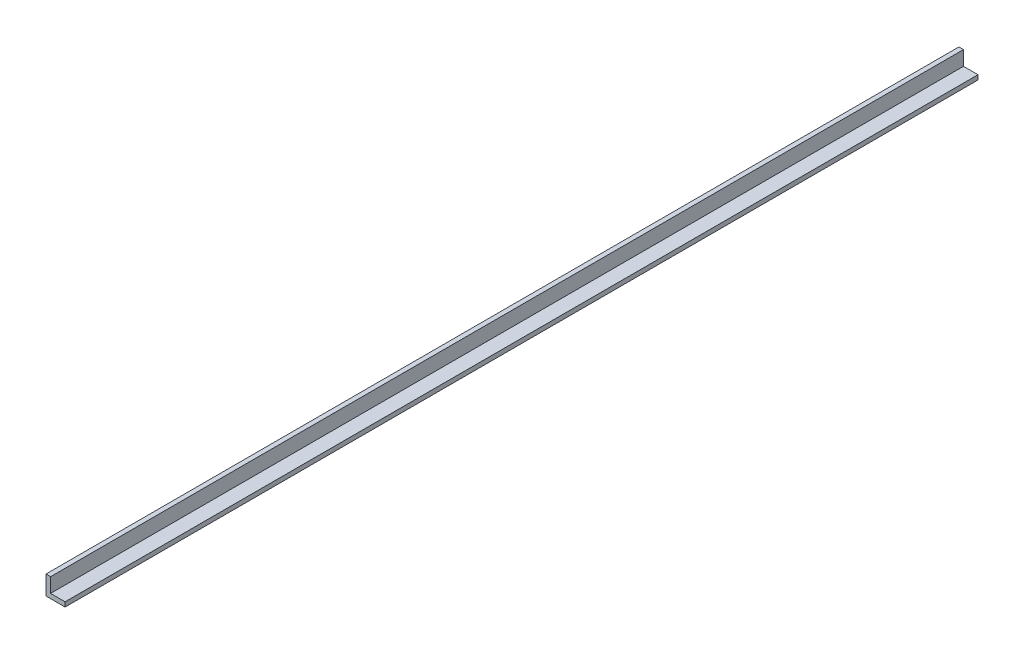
ISO-10303-21;
HEADER;
FILE_DESCRIPTION(('STEP AP214'),'2;1');
FILE_NAME('part.step','',(''),(''),'','','');
FILE_SCHEMA(('AUTOMOTIVE_DESIGN { 1 0 10303 214 1 1 1 1 }'));
ENDSEC;
DATA;
#1=APPLICATION_CONTEXT('core data for automotive mechanical design processes');
#2=APPLICATION_PROTOCOL_DEFINITION('international standard','automotive_design',2000,#1);
#3=PRODUCT_CONTEXT('',#1,'mechanical');
#4=PRODUCT('Part','Part','',(#3));
#5=PRODUCT_RELATED_PRODUCT_CATEGORY('part','',(#4));
#6=PRODUCT_DEFINITION_FORMATION('','',#4);
#7=PRODUCT_DEFINITION_CONTEXT('part definition',#1,'design');
#8=PRODUCT_DEFINITION('design','',#6,#7);
#9=PRODUCT_DEFINITION_SHAPE('','',#8);
#10=(LENGTH_UNIT() NAMED_UNIT(*) SI_UNIT(.MILLI.,.METRE.));
#11=(NAMED_UNIT(*) PLANE_ANGLE_UNIT() SI_UNIT($,.RADIAN.));
#12=(NAMED_UNIT(*) SI_UNIT($,.STERADIAN.) SOLID_ANGLE_UNIT());
#13=UNCERTAINTY_MEASURE_WITH_UNIT(LENGTH_MEASURE(1.E-05),#10,'distance_accuracy_value','');
#14=(GEOMETRIC_REPRESENTATION_CONTEXT(3) GLOBAL_UNCERTAINTY_ASSIGNED_CONTEXT((#13)) GLOBAL_UNIT_ASSIGNED_CONTEXT((#10,
#11,#12)) REPRESENTATION_CONTEXT('',''));
#15=CARTESIAN_POINT('',(0.,0.,0.));
#16=DIRECTION('',(0.,0.,1.));
#17=DIRECTION('',(1.,0.,0.));
#18=AXIS2_PLACEMENT_3D('',#15,#16,#17);
#19=CARTESIAN_POINT('',(0.,0.,2390.));
#20=DIRECTION('',(1.,0.,0.));
#21=DIRECTION('',(0.,0.,-1.));
#22=AXIS2_PLACEMENT_3D('',#19,#20,#21);
#23=PLANE('',#22);
#24=DIRECTION('',(0.,-1.,0.));
#25=VECTOR('',#24,1.);
#26=CARTESIAN_POINT('',(0.,0.,0.));
#27=LINE('',#26,#25);
#28=CARTESIAN_POINT('',(0.,50.,0.));
#29=VERTEX_POINT('',#28);
#30=CARTESIAN_POINT('',(0.,0.,0.));
#31=VERTEX_POINT('',#30);
#32=EDGE_CURVE('E117',#29,#31,#27,.T.);
#33=ORIENTED_EDGE('',*,*,#32,.T.);
#34=DIRECTION('',(0.,0.,-1.));
#35=VECTOR('',#34,1.);
#36=CARTESIAN_POINT('',(0.,0.,2390.));
#37=LINE('',#36,#35);
#38=CARTESIAN_POINT('',(0.,0.,2390.));
#39=VERTEX_POINT('',#38);
#40=EDGE_CURVE('E11',#39,#31,#37,.T.);
#41=ORIENTED_EDGE('',*,*,#40,.F.);
#42=DIRECTION('',(0.,-1.,0.));
#43=VECTOR('',#42,1.);
#44=CARTESIAN_POINT('',(0.,0.,2390.));
#45=LINE('',#44,#43);
#46=CARTESIAN_POINT('',(0.,50.,2390.));
#47=VERTEX_POINT('',#46);
#48=EDGE_CURVE('E127',#47,#39,#45,.T.);
#49=ORIENTED_EDGE('',*,*,#48,.F.);
#50=DIRECTION('',(0.,0.,-1.));
#51=VECTOR('',#50,1.);
#52=CARTESIAN_POINT('',(0.,50.,2390.));
#53=LINE('',#52,#51);
#54=EDGE_CURVE('E113',#47,#29,#53,.T.);
#55=ORIENTED_EDGE('',*,*,#54,.T.);
#56=EDGE_LOOP('',(#33,#41,#49,#55));
#57=FACE_BOUND('',#56,.T.);
#58=ADVANCED_FACE('F33',(#57),#23,.F.);
#59=CARTESIAN_POINT('',(0.,0.,2390.));
#60=DIRECTION('',(0.,1.,0.));
#61=DIRECTION('',(0.,0.,1.));
#62=AXIS2_PLACEMENT_3D('',#59,#60,#61);
#63=PLANE('',#62);
#64=DIRECTION('',(1.,0.,0.));
#65=VECTOR('',#64,1.);
#66=CARTESIAN_POINT('',(0.,0.,0.));
#67=LINE('',#66,#65);
#68=CARTESIAN_POINT('',(50.,0.,0.));
#69=VERTEX_POINT('',#68);
#70=EDGE_CURVE('E120',#31,#69,#67,.T.);
#71=ORIENTED_EDGE('',*,*,#70,.T.);
#72=DIRECTION('',(0.,0.,-1.));
#73=VECTOR('',#72,1.);
#74=CARTESIAN_POINT('',(50.,0.,2390.));
#75=LINE('',#74,#73);
#76=CARTESIAN_POINT('',(50.,0.,2390.));
#77=VERTEX_POINT('',#76);
#78=EDGE_CURVE('E41',#77,#69,#75,.T.);
#79=ORIENTED_EDGE('',*,*,#78,.F.);
#80=DIRECTION('',(1.,0.,0.));
#81=VECTOR('',#80,1.);
#82=CARTESIAN_POINT('',(0.,0.,2390.));
#83=LINE('',#82,#81);
#84=EDGE_CURVE('E86',#39,#77,#83,.T.);
#85=ORIENTED_EDGE('',*,*,#84,.F.);
#86=ORIENTED_EDGE('',*,*,#40,.T.);
#87=EDGE_LOOP('',(#71,#79,#85,#86));
#88=FACE_BOUND('',#87,.T.);
#89=ADVANCED_FACE('F151',(#88),#63,.F.);
#90=CARTESIAN_POINT('',(50.,0.,2390.));
#91=DIRECTION('',(-1.,0.,0.));
#92=DIRECTION('',(0.,0.,1.));
#93=AXIS2_PLACEMENT_3D('',#90,#91,#92);
#94=PLANE('',#93);
#95=DIRECTION('',(0.,1.,0.));
#96=VECTOR('',#95,1.);
#97=CARTESIAN_POINT('',(50.,0.,0.));
#98=LINE('',#97,#96);
#99=CARTESIAN_POINT('',(50.,12.,0.));
#100=VERTEX_POINT('',#99);
#101=EDGE_CURVE('E122',#69,#100,#98,.T.);
#102=ORIENTED_EDGE('',*,*,#101,.T.);
#103=DIRECTION('',(0.,0.,-1.));
#104=VECTOR('',#103,1.);
#105=CARTESIAN_POINT('',(50.,12.,2390.));
#106=LINE('',#105,#104);
#107=CARTESIAN_POINT('',(50.,12.,2390.));
#108=VERTEX_POINT('',#107);
#109=EDGE_CURVE('E108',#108,#100,#106,.T.);
#110=ORIENTED_EDGE('',*,*,#109,.F.);
#111=DIRECTION('',(0.,1.,0.));
#112=VECTOR('',#111,1.);
#113=CARTESIAN_POINT('',(50.,0.,2390.));
#114=LINE('',#113,#112);
#115=EDGE_CURVE('E99',#77,#108,#114,.T.);
#116=ORIENTED_EDGE('',*,*,#115,.F.);
#117=ORIENTED_EDGE('',*,*,#78,.T.);
#118=EDGE_LOOP('',(#102,#110,#116,#117));
#119=FACE_BOUND('',#118,.T.);
#120=ADVANCED_FACE('F133',(#119),#94,.F.);
#121=CARTESIAN_POINT('',(12.,12.,2390.));
#122=DIRECTION('',(0.,-1.,0.));
#123=DIRECTION('',(0.,0.,-1.));
#124=AXIS2_PLACEMENT_3D('',#121,#122,#123);
#125=PLANE('',#124);
#126=DIRECTION('',(-1.,0.,0.));
#127=VECTOR('',#126,1.);
#128=CARTESIAN_POINT('',(12.,12.,0.));
#129=LINE('',#128,#127);
#130=CARTESIAN_POINT('',(12.,12.,0.));
#131=VERTEX_POINT('',#130);
#132=EDGE_CURVE('E107',#100,#131,#129,.T.);
#133=ORIENTED_EDGE('',*,*,#132,.T.);
#134=DIRECTION('',(0.,0.,-1.));
#135=VECTOR('',#134,1.);
#136=CARTESIAN_POINT('',(12.,12.,2390.));
#137=LINE('',#136,#135);
#138=CARTESIAN_POINT('',(12.,12.,2390.));
#139=VERTEX_POINT('',#138);
#140=EDGE_CURVE('E104',#139,#131,#137,.T.);
#141=ORIENTED_EDGE('',*,*,#140,.F.);
#142=DIRECTION('',(-1.,0.,0.));
#143=VECTOR('',#142,1.);
#144=CARTESIAN_POINT('',(12.,12.,2390.));
#145=LINE('',#144,#143);
#146=EDGE_CURVE('E93',#108,#139,#145,.T.);
#147=ORIENTED_EDGE('',*,*,#146,.F.);
#148=ORIENTED_EDGE('',*,*,#109,.T.);
#149=EDGE_LOOP('',(#133,#141,#147,#148));
#150=FACE_BOUND('',#149,.T.);
#151=ADVANCED_FACE('F105',(#150),#125,.F.);
#152=CARTESIAN_POINT('',(12.,12.,2390.));
#153=DIRECTION('',(-1.,0.,0.));
#154=DIRECTION('',(0.,-1.,0.));
#155=AXIS2_PLACEMENT_3D('',#152,#153,#154);
#156=PLANE('',#155);
#157=DIRECTION('',(0.,1.,0.));
#158=VECTOR('',#157,1.);
#159=CARTESIAN_POINT('',(12.,12.,0.));
#160=LINE('',#159,#158);
#161=CARTESIAN_POINT('',(12.,50.,0.));
#162=VERTEX_POINT('',#161);
#163=EDGE_CURVE('E72',#131,#162,#160,.T.);
#164=ORIENTED_EDGE('',*,*,#163,.T.);
#165=DIRECTION('',(0.,0.,-1.));
#166=VECTOR('',#165,1.);
#167=CARTESIAN_POINT('',(12.,50.,2390.));
#168=LINE('',#167,#166);
#169=CARTESIAN_POINT('',(12.,50.,2390.));
#170=VERTEX_POINT('',#169);
#171=EDGE_CURVE('E109',#170,#162,#168,.T.);
#172=ORIENTED_EDGE('',*,*,#171,.F.);
#173=DIRECTION('',(0.,1.,0.));
#174=VECTOR('',#173,1.);
#175=CARTESIAN_POINT('',(12.,12.,2390.));
#176=LINE('',#175,#174);
#177=EDGE_CURVE('E97',#139,#170,#176,.T.);
#178=ORIENTED_EDGE('',*,*,#177,.F.);
#179=ORIENTED_EDGE('',*,*,#140,.T.);
#180=EDGE_LOOP('',(#164,#172,#178,#179));
#181=FACE_BOUND('',#180,.T.);
#182=ADVANCED_FACE('F111',(#181),#156,.F.);
#183=CARTESIAN_POINT('',(12.,50.,2390.));
#184=DIRECTION('',(0.,-1.,0.));
#185=DIRECTION('',(0.,0.,-1.));
#186=AXIS2_PLACEMENT_3D('',#183,#184,#185);
#187=PLANE('',#186);
#188=DIRECTION('',(-1.,0.,0.));
#189=VECTOR('',#188,1.);
#190=CARTESIAN_POINT('',(12.,50.,0.));
#191=LINE('',#190,#189);
#192=EDGE_CURVE('E78',#162,#29,#191,.T.);
#193=ORIENTED_EDGE('',*,*,#192,.T.);
#194=ORIENTED_EDGE('',*,*,#54,.F.);
#195=DIRECTION('',(-1.,0.,0.));
#196=VECTOR('',#195,1.);
#197=CARTESIAN_POINT('',(12.,50.,2390.));
#198=LINE('',#197,#196);
#199=EDGE_CURVE('E49',#170,#47,#198,.T.);
#200=ORIENTED_EDGE('',*,*,#199,.F.);
#201=ORIENTED_EDGE('',*,*,#171,.T.);
#202=EDGE_LOOP('',(#193,#194,#200,#201));
#203=FACE_BOUND('',#202,.T.);
#204=ADVANCED_FACE('F140',(#203),#187,.F.);
#205=CARTESIAN_POINT('',(0.,0.,2390.));
#206=DIRECTION('',(0.,0.,1.));
#207=DIRECTION('',(1.,0.,0.));
#208=AXIS2_PLACEMENT_3D('',#205,#206,#207);
#209=PLANE('',#208);
#210=ORIENTED_EDGE('',*,*,#48,.T.);
#211=ORIENTED_EDGE('',*,*,#84,.T.);
#212=ORIENTED_EDGE('',*,*,#115,.T.);
#213=ORIENTED_EDGE('',*,*,#146,.T.);
#214=ORIENTED_EDGE('',*,*,#177,.T.);
#215=ORIENTED_EDGE('',*,*,#199,.T.);
#216=EDGE_LOOP('',(#210,#211,#212,#213,#214,#215));
#217=FACE_BOUND('',#216,.T.);
#218=ADVANCED_FACE('F95',(#217),#209,.T.);
#219=CARTESIAN_POINT('',(0.,0.,0.));
#220=DIRECTION('',(0.,0.,1.));
#221=DIRECTION('',(1.,0.,0.));
#222=AXIS2_PLACEMENT_3D('',#219,#220,#221);
#223=PLANE('',#222);
#224=ORIENTED_EDGE('',*,*,#32,.F.);
#225=ORIENTED_EDGE('',*,*,#192,.F.);
#226=ORIENTED_EDGE('',*,*,#163,.F.);
#227=ORIENTED_EDGE('',*,*,#132,.F.);
#228=ORIENTED_EDGE('',*,*,#101,.F.);
#229=ORIENTED_EDGE('',*,*,#70,.F.);
#230=EDGE_LOOP('',(#224,#225,#226,#227,#228,#229));
#231=FACE_BOUND('',#230,.T.);
#232=ADVANCED_FACE('F136',(#231),#223,.F.);
#233=CLOSED_SHELL('',(#58,#89,#120,#151,#182,#204,#218,#232));
#234=MANIFOLD_SOLID_BREP('B2',#233);
#235=ADVANCED_BREP_SHAPE_REPRESENTATION('',(#18,#234),#14);
#236=SHAPE_DEFINITION_REPRESENTATION(#9,#235);
ENDSEC;
END-ISO-10303-21;
